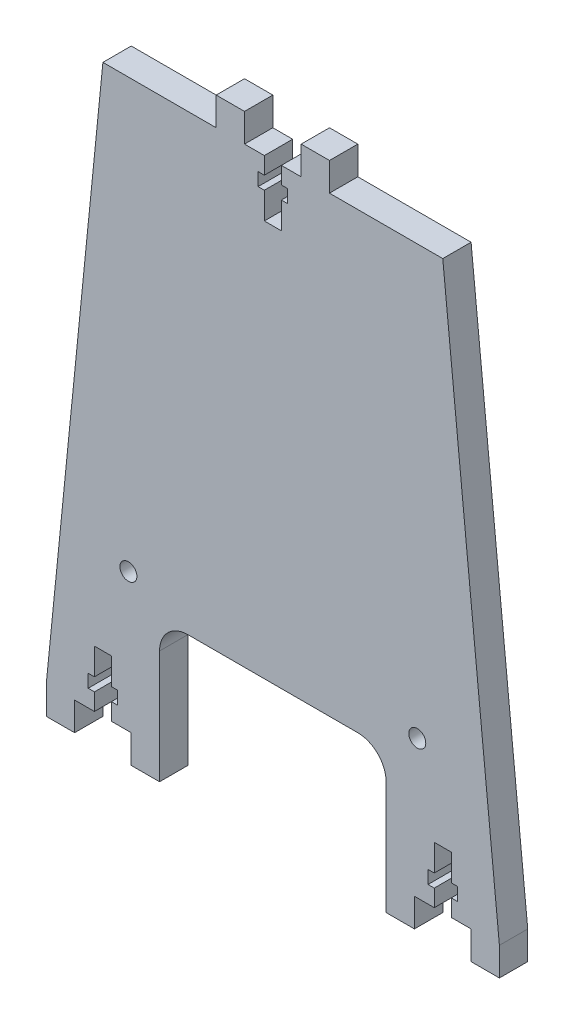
from build123d import *

# Parameters (mm, degrees)
SKETCH1_R           = 1.5
BOSS_EXTRUDE1_DEPTH = 5
FILLET1_R           = 5


with BuildPart() as part:
    # Sketch1 → Boss-Extrude1 (new body)
    with BuildSketch(Plane.XY):
        Polygon((0, 100), (20, 100), (20, 105), (25, 105), (25, 100), (28.5, 100), (28.5, 97), (27.4, 97), (27.4, 94.7), (28.5, 94.7), (28.5, 90), (31.5, 90), (31.5, 94.7), (32.6, 94.7), (32.6, 97), (31.5, 97), (31.5, 100), (35, 100), (35, 105), (40, 105), (40, 100), (60, 100), (70, 0), (70, -5), (65, -5), (65, 0), (61.5, 0), (61.5, 3), (62.6, 3), (62.6, 5.3), (61.5, 5.3), (61.5, 10), (58.5, 10), (58.5, 5.3), (57.4, 5.3), (57.4, 3), (58.5, 3), (58.5, 0), (55, 0), (55, -5), (50, -5), (50, 0), (50, 20), (10, 20), (10, 0), (10, -5), (5, -5), (5, 0), (1.5, 0), (1.5, 3), (2.6, 3), (2.6, 5.3), (1.5, 5.3), (1.5, 10), (-1.5, 10), (-1.5, 5.3), (-2.6, 5.3), (-2.6, 3), (-1.5, 3), (-1.5, 0), (-5, 0), (-5, -5), (-10, -5), (-10, 0), align=None)
        with Locations((55.5, 24.4)):
            Circle(SKETCH1_R, mode=Mode.SUBTRACT)
        with Locations(Location((4.5, 24.4, 0), (0, 0, 180))):
            Circle(SKETCH1_R, mode=Mode.SUBTRACT)
    extrude(amount=BOSS_EXTRUDE1_DEPTH)

    # Fillet1
    fillet1_edges = [part.edges().sort_by_distance(p)[0] for p in [
        (50, 20, 2.5),
        (10, 20, 2.5),
    ]]
    fillet(fillet1_edges, radius=FILLET1_R)


solid = part.part
